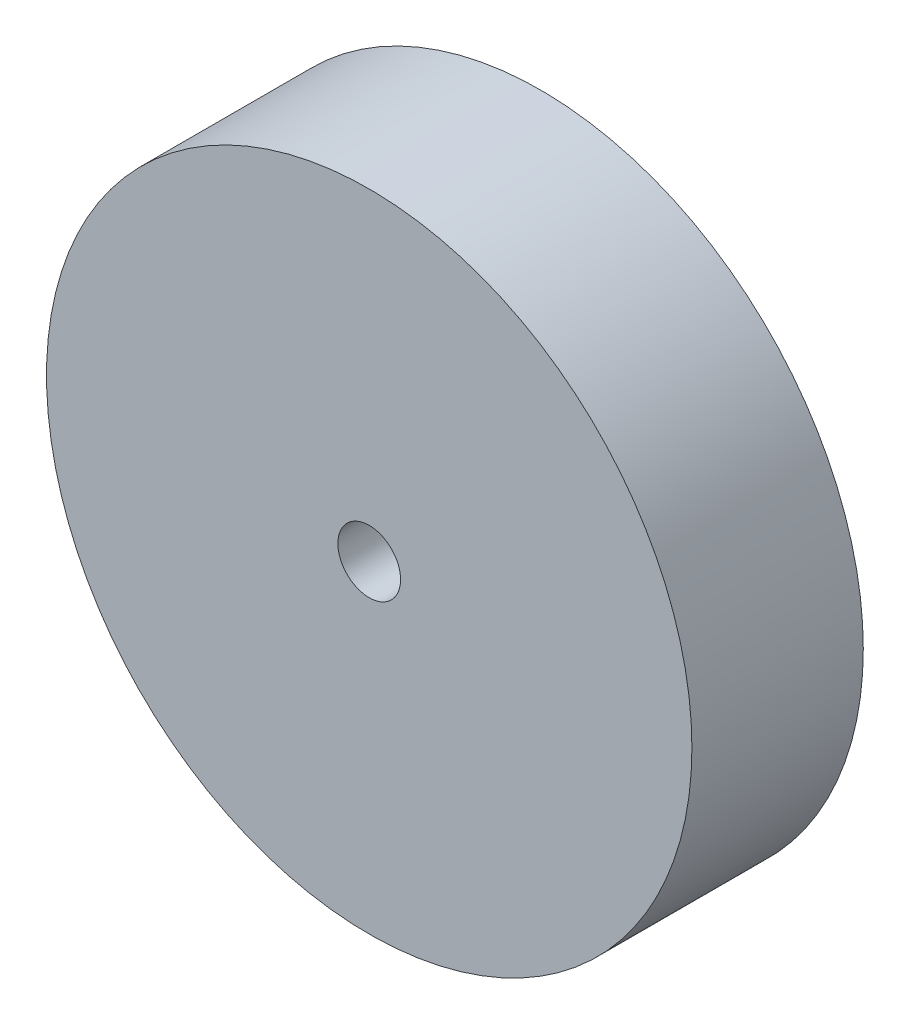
ISO-10303-21;
HEADER;
FILE_DESCRIPTION(('STEP AP214'),'2;1');
FILE_NAME('part.step','',(''),(''),'','','');
FILE_SCHEMA(('AUTOMOTIVE_DESIGN { 1 0 10303 214 1 1 1 1 }'));
ENDSEC;
DATA;
#1=APPLICATION_CONTEXT('core data for automotive mechanical design processes');
#2=APPLICATION_PROTOCOL_DEFINITION('international standard','automotive_design',2000,#1);
#3=PRODUCT_CONTEXT('',#1,'mechanical');
#4=PRODUCT('Part','Part','',(#3));
#5=PRODUCT_RELATED_PRODUCT_CATEGORY('part','',(#4));
#6=PRODUCT_DEFINITION_FORMATION('','',#4);
#7=PRODUCT_DEFINITION_CONTEXT('part definition',#1,'design');
#8=PRODUCT_DEFINITION('design','',#6,#7);
#9=PRODUCT_DEFINITION_SHAPE('','',#8);
#10=(LENGTH_UNIT() NAMED_UNIT(*) SI_UNIT(.MILLI.,.METRE.));
#11=(NAMED_UNIT(*) PLANE_ANGLE_UNIT() SI_UNIT($,.RADIAN.));
#12=(NAMED_UNIT(*) SI_UNIT($,.STERADIAN.) SOLID_ANGLE_UNIT());
#13=UNCERTAINTY_MEASURE_WITH_UNIT(LENGTH_MEASURE(1.E-05),#10,'distance_accuracy_value','');
#14=(GEOMETRIC_REPRESENTATION_CONTEXT(3) GLOBAL_UNCERTAINTY_ASSIGNED_CONTEXT((#13)) GLOBAL_UNIT_ASSIGNED_CONTEXT((#10,
#11,#12)) REPRESENTATION_CONTEXT('',''));
#15=CARTESIAN_POINT('',(0.,0.,0.));
#16=DIRECTION('',(0.,0.,1.));
#17=DIRECTION('',(1.,0.,0.));
#18=AXIS2_PLACEMENT_3D('',#15,#16,#17);
#19=CARTESIAN_POINT('',(0.,0.,2.05));
#20=DIRECTION('',(0.,0.,1.));
#21=DIRECTION('',(1.,0.,0.));
#22=AXIS2_PLACEMENT_3D('',#19,#20,#21);
#23=PLANE('',#22);
#24=CARTESIAN_POINT('',(0.,0.,2.05));
#25=DIRECTION('',(0.,0.,1.));
#26=DIRECTION('',(1.,0.,0.));
#27=AXIS2_PLACEMENT_3D('',#24,#25,#26);
#28=CIRCLE('',#27,3.86);
#29=CARTESIAN_POINT('',(3.86,0.,2.05));
#30=VERTEX_POINT('',#29);
#31=EDGE_CURVE('E10',#30,#30,#28,.T.);
#32=ORIENTED_EDGE('',*,*,#31,.T.);
#33=EDGE_LOOP('',(#32));
#34=FACE_BOUND('',#33,.T.);
#35=CARTESIAN_POINT('',(0.,0.,2.05));
#36=DIRECTION('',(0.,0.,1.));
#37=DIRECTION('',(1.,0.,0.));
#38=AXIS2_PLACEMENT_3D('',#35,#36,#37);
#39=CIRCLE('',#38,0.375);
#40=CARTESIAN_POINT('',(0.375,0.,2.05));
#41=VERTEX_POINT('',#40);
#42=EDGE_CURVE('E50',#41,#41,#39,.T.);
#43=ORIENTED_EDGE('',*,*,#42,.F.);
#44=EDGE_LOOP('',(#43));
#45=FACE_BOUND('',#44,.T.);
#46=ADVANCED_FACE('F37',(#34,#45),#23,.T.);
#47=CARTESIAN_POINT('',(0.,0.,0.));
#48=DIRECTION('',(0.,0.,1.));
#49=DIRECTION('',(1.,0.,0.));
#50=AXIS2_PLACEMENT_3D('',#47,#48,#49);
#51=PLANE('',#50);
#52=CARTESIAN_POINT('',(0.,0.,0.));
#53=DIRECTION('',(0.,0.,1.));
#54=DIRECTION('',(1.,0.,0.));
#55=AXIS2_PLACEMENT_3D('',#52,#53,#54);
#56=CIRCLE('',#55,3.86);
#57=CARTESIAN_POINT('',(3.86,0.,0.));
#58=VERTEX_POINT('',#57);
#59=EDGE_CURVE('E41',#58,#58,#56,.T.);
#60=ORIENTED_EDGE('',*,*,#59,.F.);
#61=EDGE_LOOP('',(#60));
#62=FACE_BOUND('',#61,.T.);
#63=CARTESIAN_POINT('',(0.,0.,0.));
#64=DIRECTION('',(0.,0.,1.));
#65=DIRECTION('',(1.,0.,0.));
#66=AXIS2_PLACEMENT_3D('',#63,#64,#65);
#67=CIRCLE('',#66,0.375);
#68=CARTESIAN_POINT('',(0.375,0.,0.));
#69=VERTEX_POINT('',#68);
#70=EDGE_CURVE('E52',#69,#69,#67,.T.);
#71=ORIENTED_EDGE('',*,*,#70,.T.);
#72=EDGE_LOOP('',(#71));
#73=FACE_BOUND('',#72,.T.);
#74=ADVANCED_FACE('F64',(#62,#73),#51,.F.);
#75=CARTESIAN_POINT('',(0.,0.,2.05));
#76=DIRECTION('',(0.,0.,-1.));
#77=DIRECTION('',(-1.,0.,0.));
#78=AXIS2_PLACEMENT_3D('',#75,#76,#77);
#79=CYLINDRICAL_SURFACE('',#78,3.86);
#80=ORIENTED_EDGE('',*,*,#31,.F.);
#81=EDGE_LOOP('',(#80));
#82=FACE_BOUND('',#81,.T.);
#83=ORIENTED_EDGE('',*,*,#59,.T.);
#84=EDGE_LOOP('',(#83));
#85=FACE_BOUND('',#84,.T.);
#86=ADVANCED_FACE('F39',(#82,#85),#79,.T.);
#87=CARTESIAN_POINT('',(0.,0.,2.05));
#88=DIRECTION('',(0.,0.,-1.));
#89=DIRECTION('',(-1.,0.,0.));
#90=AXIS2_PLACEMENT_3D('',#87,#88,#89);
#91=CYLINDRICAL_SURFACE('',#90,0.375);
#92=ORIENTED_EDGE('',*,*,#42,.T.);
#93=EDGE_LOOP('',(#92));
#94=FACE_BOUND('',#93,.T.);
#95=ORIENTED_EDGE('',*,*,#70,.F.);
#96=EDGE_LOOP('',(#95));
#97=FACE_BOUND('',#96,.T.);
#98=ADVANCED_FACE('F60',(#94,#97),#91,.F.);
#99=CLOSED_SHELL('',(#46,#74,#86,#98));
#100=MANIFOLD_SOLID_BREP('B2',#99);
#101=ADVANCED_BREP_SHAPE_REPRESENTATION('',(#18,#100),#14);
#102=SHAPE_DEFINITION_REPRESENTATION(#9,#101);
ENDSEC;
END-ISO-10303-21;
